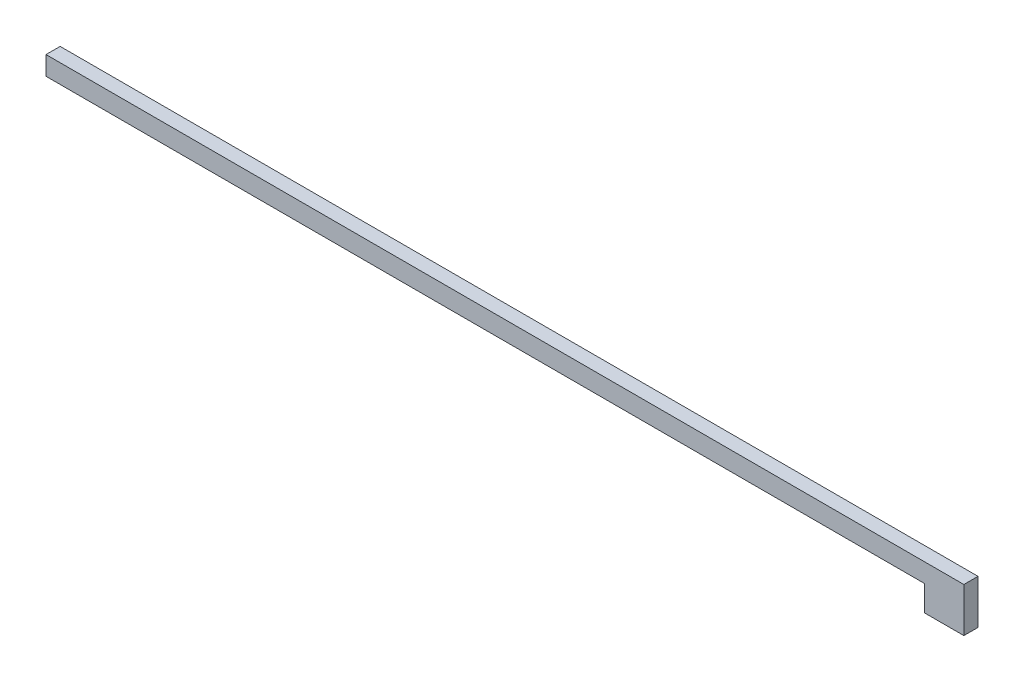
from build123d import *

# Parameters (mm, degrees)
EXTRUDE1_DEPTH = 3.81


with BuildPart() as part:
    # Sketch1 → Extrude1 (new body)
    with BuildSketch(Plane.XY):
        Polygon((-122.621316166, 19.304363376), (114.106683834, 19.304363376), (114.106683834, 12.446363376), (124.774683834, 12.446363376), (124.774683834, 19.304363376), (124.774683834, 24.384363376), (-122.621316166, 24.384363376), align=None)
    extrude(amount=EXTRUDE1_DEPTH)


solid = part.part
